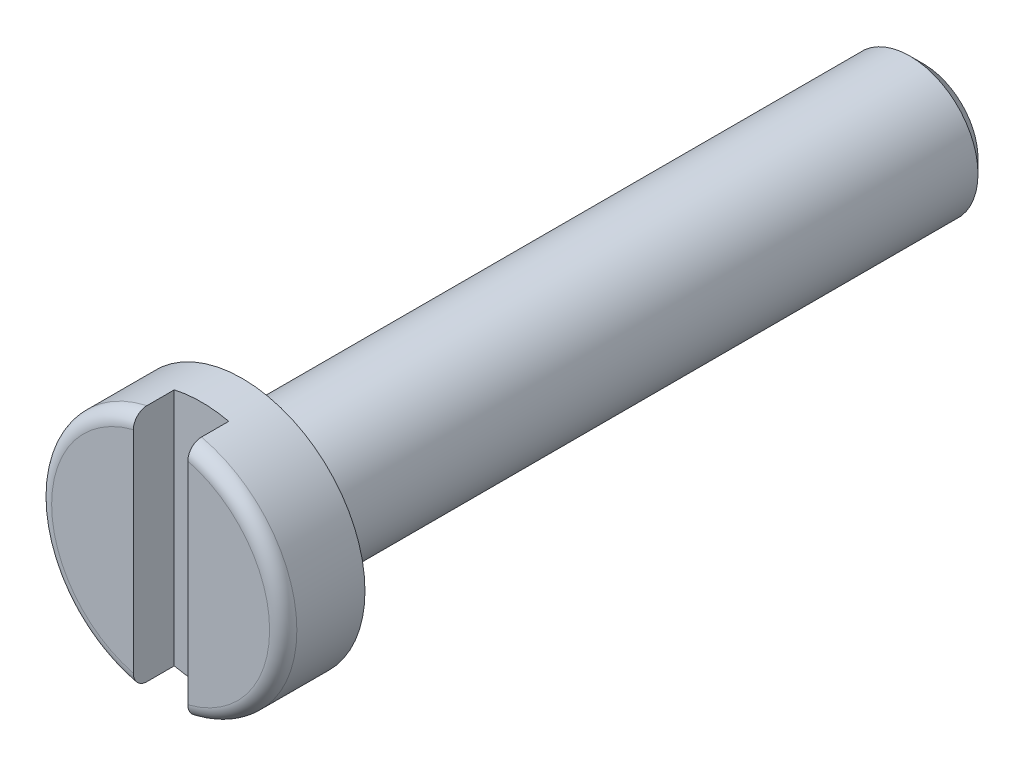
from build123d import *

# Parameters (mm, degrees)
ESQUISSE1_R             = 4.5
BOSS_EXTRU_1_DEPTH      = 3
ESQUISSE2_R             = 2.5
BOSS_EXTRU_2_DEPTH      = 25
CHANFREIN1_SIZE         = 0.5
CONG_1_R                = 0.5
ESQUISSE3_W             = 2
ESQUISSE3_H             = 9.939239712
ENL_V_MAT_EXTRU_1_DEPTH = 1.5


with BuildPart() as part:
    # Esquisse1 → Boss.-Extru.1 (new body)
    with BuildSketch(Plane.XY):
        Circle(ESQUISSE1_R)
    extrude(amount=BOSS_EXTRU_1_DEPTH)

    # Esquisse2 → Boss.-Extru.2 (add)
    with BuildSketch(Plane(origin=(0, 0, 0), x_dir=(-1, 0, 0), z_dir=(0, 0, -1))):
        with Locations(Location((0, 0, 0), (0, 0, 180))):
            Circle(ESQUISSE2_R)
    extrude(amount=BOSS_EXTRU_2_DEPTH)

    # Chanfrein1
    chanfrein1_edges = [part.edges().sort_by_distance(p)[0] for p in [
        (-2.5, 0, -25),
    ]]
    chamfer(chanfrein1_edges, length=CHANFREIN1_SIZE)

    # Cong_1
    cong_1_edges = [part.edges().sort_by_distance(p)[0] for p in [
        (-4.5, 0, 3),
    ]]
    fillet(cong_1_edges, radius=CONG_1_R)

    # Esquisse3 → Enl_v. mat.-Extru.1 (cut)
    with BuildSketch(Plane.XY.offset(3)):
        with Locations((0, -0.124950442)):
            Rectangle(ESQUISSE3_W, ESQUISSE3_H)
    extrude(amount=-ENL_V_MAT_EXTRU_1_DEPTH, mode=Mode.SUBTRACT)


solid = part.part
